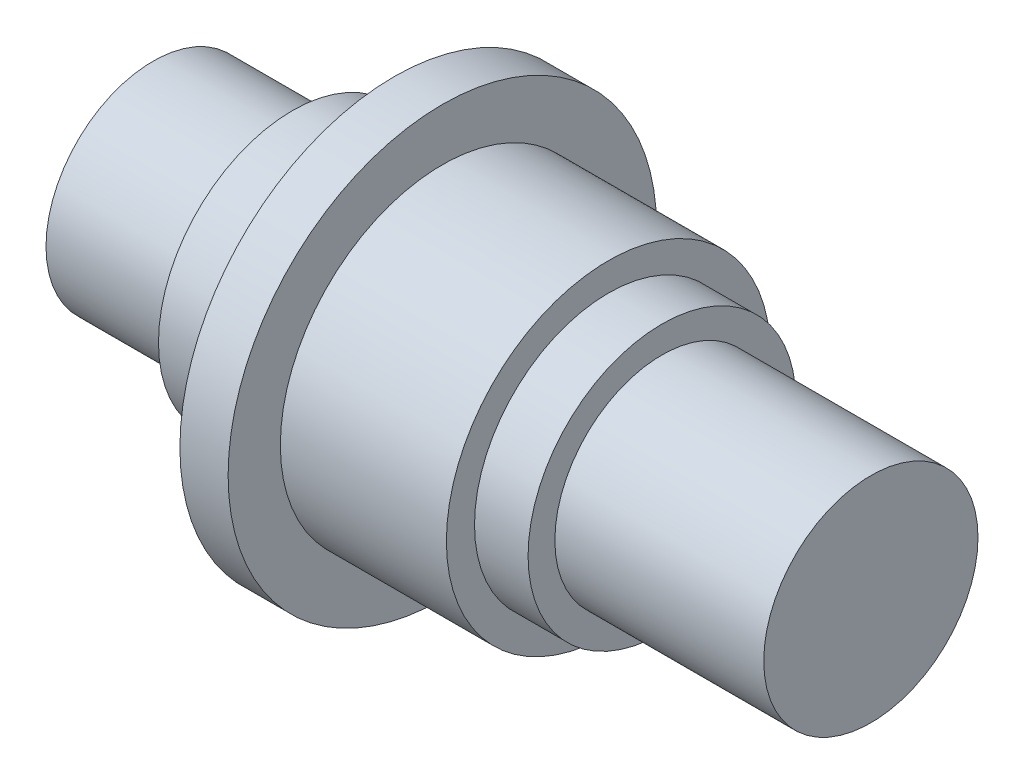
ISO-10303-21;
HEADER;
FILE_DESCRIPTION(('STEP AP214'),'2;1');
FILE_NAME('part.step','',(''),(''),'','','');
FILE_SCHEMA(('AUTOMOTIVE_DESIGN { 1 0 10303 214 1 1 1 1 }'));
ENDSEC;
DATA;
#1=APPLICATION_CONTEXT('core data for automotive mechanical design processes');
#2=APPLICATION_PROTOCOL_DEFINITION('international standard','automotive_design',2000,#1);
#3=PRODUCT_CONTEXT('',#1,'mechanical');
#4=PRODUCT('Part','Part','',(#3));
#5=PRODUCT_RELATED_PRODUCT_CATEGORY('part','',(#4));
#6=PRODUCT_DEFINITION_FORMATION('','',#4);
#7=PRODUCT_DEFINITION_CONTEXT('part definition',#1,'design');
#8=PRODUCT_DEFINITION('design','',#6,#7);
#9=PRODUCT_DEFINITION_SHAPE('','',#8);
#10=(LENGTH_UNIT() NAMED_UNIT(*) SI_UNIT(.MILLI.,.METRE.));
#11=(NAMED_UNIT(*) PLANE_ANGLE_UNIT() SI_UNIT($,.RADIAN.));
#12=(NAMED_UNIT(*) SI_UNIT($,.STERADIAN.) SOLID_ANGLE_UNIT());
#13=UNCERTAINTY_MEASURE_WITH_UNIT(LENGTH_MEASURE(1.E-05),#10,'distance_accuracy_value','');
#14=(GEOMETRIC_REPRESENTATION_CONTEXT(3) GLOBAL_UNCERTAINTY_ASSIGNED_CONTEXT((#13)) GLOBAL_UNIT_ASSIGNED_CONTEXT((#10,
#11,#12)) REPRESENTATION_CONTEXT('',''));
#15=CARTESIAN_POINT('',(0.,0.,0.));
#16=DIRECTION('',(0.,0.,1.));
#17=DIRECTION('',(1.,0.,0.));
#18=AXIS2_PLACEMENT_3D('',#15,#16,#17);
#19=CARTESIAN_POINT('',(2.45,0.,0.));
#20=DIRECTION('',(-1.,0.,0.));
#21=DIRECTION('',(0.,0.,1.));
#22=AXIS2_PLACEMENT_3D('',#19,#20,#21);
#23=CYLINDRICAL_SURFACE('',#22,3.025);
#24=CARTESIAN_POINT('',(2.45,0.,0.));
#25=DIRECTION('',(1.,0.,0.));
#26=DIRECTION('',(0.,0.,-1.));
#27=AXIS2_PLACEMENT_3D('',#24,#25,#26);
#28=CIRCLE('',#27,3.025);
#29=CARTESIAN_POINT('',(2.45,0.,-3.025));
#30=VERTEX_POINT('',#29);
#31=EDGE_CURVE('E55',#30,#30,#28,.T.);
#32=ORIENTED_EDGE('',*,*,#31,.F.);
#33=EDGE_LOOP('',(#32));
#34=FACE_BOUND('',#33,.T.);
#35=CARTESIAN_POINT('',(-0.65,0.,0.));
#36=DIRECTION('',(-1.,0.,0.));
#37=DIRECTION('',(0.,0.,1.));
#38=AXIS2_PLACEMENT_3D('',#35,#36,#37);
#39=CIRCLE('',#38,3.025);
#40=CARTESIAN_POINT('',(-0.65,0.,3.025));
#41=VERTEX_POINT('',#40);
#42=EDGE_CURVE('E10',#41,#41,#39,.T.);
#43=ORIENTED_EDGE('',*,*,#42,.F.);
#44=EDGE_LOOP('',(#43));
#45=FACE_BOUND('',#44,.T.);
#46=ADVANCED_FACE('F33',(#34,#45),#23,.T.);
#47=CARTESIAN_POINT('',(-6.05,0.,0.));
#48=DIRECTION('',(1.,0.,0.));
#49=DIRECTION('',(0.,0.,-1.));
#50=AXIS2_PLACEMENT_3D('',#47,#48,#49);
#51=CYLINDRICAL_SURFACE('',#50,2.);
#52=CARTESIAN_POINT('',(7.35,0.,0.));
#53=DIRECTION('',(1.,0.,0.));
#54=DIRECTION('',(0.,0.,-1.));
#55=AXIS2_PLACEMENT_3D('',#52,#53,#54);
#56=CIRCLE('',#55,2.);
#57=CARTESIAN_POINT('',(7.35,0.,-2.));
#58=VERTEX_POINT('',#57);
#59=EDGE_CURVE('E49',#58,#58,#56,.T.);
#60=ORIENTED_EDGE('',*,*,#59,.F.);
#61=EDGE_LOOP('',(#60));
#62=FACE_BOUND('',#61,.T.);
#63=CARTESIAN_POINT('',(3.45,0.,0.));
#64=DIRECTION('',(-1.,0.,0.));
#65=DIRECTION('',(0.,0.,1.));
#66=AXIS2_PLACEMENT_3D('',#63,#64,#65);
#67=CIRCLE('',#66,2.);
#68=CARTESIAN_POINT('',(3.45,0.,2.));
#69=VERTEX_POINT('',#68);
#70=EDGE_CURVE('E53',#69,#69,#67,.F.);
#71=ORIENTED_EDGE('',*,*,#70,.T.);
#72=EDGE_LOOP('',(#71));
#73=FACE_BOUND('',#72,.T.);
#74=ADVANCED_FACE('F35',(#62,#73),#51,.T.);
#75=CARTESIAN_POINT('',(7.35,0.,0.));
#76=DIRECTION('',(1.,0.,0.));
#77=DIRECTION('',(0.,0.,-1.));
#78=AXIS2_PLACEMENT_3D('',#75,#76,#77);
#79=PLANE('',#78);
#80=ORIENTED_EDGE('',*,*,#59,.T.);
#81=EDGE_LOOP('',(#80));
#82=FACE_BOUND('',#81,.T.);
#83=ADVANCED_FACE('F82',(#82),#79,.T.);
#84=CARTESIAN_POINT('',(-3.45,0.,0.));
#85=DIRECTION('',(1.,0.,0.));
#86=DIRECTION('',(0.,0.,-1.));
#87=AXIS2_PLACEMENT_3D('',#84,#85,#86);
#88=CYLINDRICAL_SURFACE('',#87,2.5);
#89=CARTESIAN_POINT('',(2.45,0.,0.));
#90=DIRECTION('',(1.,0.,0.));
#91=DIRECTION('',(0.,0.,-1.));
#92=AXIS2_PLACEMENT_3D('',#89,#90,#91);
#93=CIRCLE('',#92,2.5);
#94=CARTESIAN_POINT('',(2.45,0.,-2.5));
#95=VERTEX_POINT('',#94);
#96=EDGE_CURVE('E56',#95,#95,#93,.F.);
#97=CARTESIAN_POINT('',(3.45,0.,0.));
#98=DIRECTION('',(-1.,0.,0.));
#99=DIRECTION('',(0.,0.,1.));
#100=AXIS2_PLACEMENT_3D('',#97,#98,#99);
#101=CIRCLE('',#100,2.5);
#102=CARTESIAN_POINT('',(3.45,0.,-2.5));
#103=VERTEX_POINT('',#102);
#104=EDGE_CURVE('E59',#103,#103,#101,.T.);
#105=CARTESIAN_POINT('',(2.45,0.,-2.5));
#106=CARTESIAN_POINT('',(2.46041666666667,0.,-2.5));
#107=CARTESIAN_POINT('',(2.47083333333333,0.,-2.5));
#108=CARTESIAN_POINT('',(2.49166666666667,0.,-2.5));
#109=CARTESIAN_POINT('',(2.50208333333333,0.,-2.5));
#110=CARTESIAN_POINT('',(2.52291666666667,0.,-2.5));
#111=CARTESIAN_POINT('',(2.53333333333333,0.,-2.5));
#112=CARTESIAN_POINT('',(2.55416666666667,0.,-2.5));
#113=CARTESIAN_POINT('',(2.56458333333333,0.,-2.5));
#114=CARTESIAN_POINT('',(2.58541666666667,0.,-2.5));
#115=CARTESIAN_POINT('',(2.59583333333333,0.,-2.5));
#116=CARTESIAN_POINT('',(2.61666666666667,0.,-2.5));
#117=CARTESIAN_POINT('',(2.62708333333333,0.,-2.5));
#118=CARTESIAN_POINT('',(2.64791666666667,0.,-2.5));
#119=CARTESIAN_POINT('',(2.65833333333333,0.,-2.5));
#120=CARTESIAN_POINT('',(2.67916666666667,0.,-2.5));
#121=CARTESIAN_POINT('',(2.68958333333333,0.,-2.5));
#122=CARTESIAN_POINT('',(2.71041666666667,0.,-2.5));
#123=CARTESIAN_POINT('',(2.72083333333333,0.,-2.5));
#124=CARTESIAN_POINT('',(2.74166666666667,0.,-2.5));
#125=CARTESIAN_POINT('',(2.75208333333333,0.,-2.5));
#126=CARTESIAN_POINT('',(2.77291666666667,0.,-2.5));
#127=CARTESIAN_POINT('',(2.78333333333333,0.,-2.5));
#128=CARTESIAN_POINT('',(2.80416666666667,0.,-2.5));
#129=CARTESIAN_POINT('',(2.81458333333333,0.,-2.5));
#130=CARTESIAN_POINT('',(2.83541666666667,0.,-2.5));
#131=CARTESIAN_POINT('',(2.84583333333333,0.,-2.5));
#132=CARTESIAN_POINT('',(2.86666666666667,0.,-2.5));
#133=CARTESIAN_POINT('',(2.87708333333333,0.,-2.5));
#134=CARTESIAN_POINT('',(2.89791666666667,0.,-2.5));
#135=CARTESIAN_POINT('',(2.90833333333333,0.,-2.5));
#136=CARTESIAN_POINT('',(2.92916666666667,0.,-2.5));
#137=CARTESIAN_POINT('',(2.93958333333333,0.,-2.5));
#138=CARTESIAN_POINT('',(2.96041666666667,0.,-2.5));
#139=CARTESIAN_POINT('',(2.97083333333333,0.,-2.5));
#140=CARTESIAN_POINT('',(2.99166666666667,0.,-2.5));
#141=CARTESIAN_POINT('',(3.00208333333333,0.,-2.5));
#142=CARTESIAN_POINT('',(3.02291666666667,0.,-2.5));
#143=CARTESIAN_POINT('',(3.03333333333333,0.,-2.5));
#144=CARTESIAN_POINT('',(3.05416666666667,0.,-2.5));
#145=CARTESIAN_POINT('',(3.06458333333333,0.,-2.5));
#146=CARTESIAN_POINT('',(3.08541666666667,0.,-2.5));
#147=CARTESIAN_POINT('',(3.09583333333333,0.,-2.5));
#148=CARTESIAN_POINT('',(3.11666666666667,0.,-2.5));
#149=CARTESIAN_POINT('',(3.12708333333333,0.,-2.5));
#150=CARTESIAN_POINT('',(3.14791666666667,0.,-2.5));
#151=CARTESIAN_POINT('',(3.15833333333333,0.,-2.5));
#152=CARTESIAN_POINT('',(3.17916666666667,0.,-2.5));
#153=CARTESIAN_POINT('',(3.18958333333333,0.,-2.5));
#154=CARTESIAN_POINT('',(3.21041666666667,0.,-2.5));
#155=CARTESIAN_POINT('',(3.22083333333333,0.,-2.5));
#156=CARTESIAN_POINT('',(3.24166666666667,0.,-2.5));
#157=CARTESIAN_POINT('',(3.25208333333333,0.,-2.5));
#158=CARTESIAN_POINT('',(3.27291666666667,0.,-2.5));
#159=CARTESIAN_POINT('',(3.28333333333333,0.,-2.5));
#160=CARTESIAN_POINT('',(3.30416666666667,0.,-2.5));
#161=CARTESIAN_POINT('',(3.31458333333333,0.,-2.5));
#162=CARTESIAN_POINT('',(3.33541666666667,0.,-2.5));
#163=CARTESIAN_POINT('',(3.34583333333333,0.,-2.5));
#164=CARTESIAN_POINT('',(3.36666666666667,0.,-2.5));
#165=CARTESIAN_POINT('',(3.37708333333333,0.,-2.5));
#166=CARTESIAN_POINT('',(3.39791666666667,0.,-2.5));
#167=CARTESIAN_POINT('',(3.40833333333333,0.,-2.5));
#168=CARTESIAN_POINT('',(3.42916666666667,0.,-2.5));
#169=CARTESIAN_POINT('',(3.43958333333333,0.,-2.5));
#170=CARTESIAN_POINT('',(3.45,0.,-2.5));
#171=B_SPLINE_CURVE_WITH_KNOTS('',3,(#105,#106,#107,#108,#109,#110,#111,#112,#113,#114,#115,
#116,#117,#118,#119,#120,#121,#122,#123,#124,#125,#126,#127,#128,#129,#130,#131,#132,#133,#134,
#135,#136,#137,#138,#139,#140,#141,#142,#143,#144,#145,#146,#147,#148,#149,#150,#151,#152,#153,
#154,#155,#156,#157,#158,#159,#160,#161,#162,#163,#164,#165,#166,#167,#168,#169,#170),
.UNSPECIFIED.,.F.,.F.,(4,2,2,2,2,2,2,2,2,2,2,2,2,2,2,2,2,2,2,2,2,2,2,2,2,2,2,2,2,2,2,2,4),(0.,
0.03125,0.0625000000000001,0.0937500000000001,0.125,0.15625,0.1875,0.21875,0.25,0.28125,0.3125,
0.34375,0.375,0.40625,0.4375,0.46875,0.5,0.53125,0.5625,0.593750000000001,0.625000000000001,
0.656250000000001,0.687500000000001,0.718750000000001,0.750000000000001,0.781250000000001,
0.812500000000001,0.843750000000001,0.875000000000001,0.906250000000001,0.937500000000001,
0.968750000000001,1.),.UNSPECIFIED.);
#172=EDGE_CURVE('BSEAM93',#95,#103,#171,.T.);
#173=ORIENTED_EDGE('',*,*,#96,.F.);
#174=ORIENTED_EDGE('',*,*,#104,.T.);
#175=ORIENTED_EDGE('',*,*,#172,.T.);
#176=ORIENTED_EDGE('',*,*,#172,.F.);
#177=EDGE_LOOP('',(#173,#175,#174,#176));
#178=FACE_BOUND('',#177,.T.);
#179=ADVANCED_FACE('F93',(#178),#88,.T.);
#180=CARTESIAN_POINT('',(3.45,0.,0.));
#181=DIRECTION('',(-1.,0.,0.));
#182=DIRECTION('',(0.,0.,1.));
#183=AXIS2_PLACEMENT_3D('',#180,#181,#182);
#184=PLANE('',#183);
#185=ORIENTED_EDGE('',*,*,#70,.F.);
#186=EDGE_LOOP('',(#185));
#187=FACE_BOUND('',#186,.T.);
#188=ORIENTED_EDGE('',*,*,#104,.F.);
#189=EDGE_LOOP('',(#188));
#190=FACE_BOUND('',#189,.T.);
#191=ADVANCED_FACE('F89',(#187,#190),#184,.F.);
#192=CARTESIAN_POINT('',(2.45,0.,0.));
#193=DIRECTION('',(1.,0.,0.));
#194=DIRECTION('',(0.,0.,-1.));
#195=AXIS2_PLACEMENT_3D('',#192,#193,#194);
#196=PLANE('',#195);
#197=ORIENTED_EDGE('',*,*,#96,.T.);
#198=EDGE_LOOP('',(#197));
#199=FACE_BOUND('',#198,.T.);
#200=ORIENTED_EDGE('',*,*,#31,.T.);
#201=EDGE_LOOP('',(#200));
#202=FACE_BOUND('',#201,.T.);
#203=ADVANCED_FACE('F92',(#199,#202),#196,.T.);
#204=CARTESIAN_POINT('',(-0.65,0.,0.));
#205=DIRECTION('',(-1.,0.,0.));
#206=DIRECTION('',(0.,0.,1.));
#207=AXIS2_PLACEMENT_3D('',#204,#205,#206);
#208=CYLINDRICAL_SURFACE('',#207,4.);
#209=CARTESIAN_POINT('',(-0.65,0.,0.));
#210=DIRECTION('',(-1.,0.,0.));
#211=DIRECTION('',(0.,0.,1.));
#212=AXIS2_PLACEMENT_3D('',#209,#210,#211);
#213=CIRCLE('',#212,4.);
#214=CARTESIAN_POINT('',(-0.65,0.,4.));
#215=VERTEX_POINT('',#214);
#216=EDGE_CURVE('E60',#215,#215,#213,.T.);
#217=ORIENTED_EDGE('',*,*,#216,.T.);
#218=EDGE_LOOP('',(#217));
#219=FACE_BOUND('',#218,.T.);
#220=CARTESIAN_POINT('',(-1.55,0.,0.));
#221=DIRECTION('',(-1.,0.,0.));
#222=DIRECTION('',(0.,0.,1.));
#223=AXIS2_PLACEMENT_3D('',#220,#221,#222);
#224=CIRCLE('',#223,4.);
#225=CARTESIAN_POINT('',(-1.55,0.,4.));
#226=VERTEX_POINT('',#225);
#227=EDGE_CURVE('E67',#226,#226,#224,.T.);
#228=ORIENTED_EDGE('',*,*,#227,.F.);
#229=EDGE_LOOP('',(#228));
#230=FACE_BOUND('',#229,.T.);
#231=ADVANCED_FACE('F133',(#219,#230),#208,.T.);
#232=CARTESIAN_POINT('',(-0.65,0.,0.));
#233=DIRECTION('',(-1.,0.,0.));
#234=DIRECTION('',(0.,0.,1.));
#235=AXIS2_PLACEMENT_3D('',#232,#233,#234);
#236=PLANE('',#235);
#237=ORIENTED_EDGE('',*,*,#42,.T.);
#238=EDGE_LOOP('',(#237));
#239=FACE_BOUND('',#238,.T.);
#240=ORIENTED_EDGE('',*,*,#216,.F.);
#241=EDGE_LOOP('',(#240));
#242=FACE_BOUND('',#241,.T.);
#243=ADVANCED_FACE('F125',(#239,#242),#236,.F.);
#244=CARTESIAN_POINT('',(-1.55,0.,0.));
#245=DIRECTION('',(-1.,0.,0.));
#246=DIRECTION('',(0.,0.,1.));
#247=AXIS2_PLACEMENT_3D('',#244,#245,#246);
#248=PLANE('',#247);
#249=CARTESIAN_POINT('',(-1.55,0.,0.));
#250=DIRECTION('',(-1.,0.,0.));
#251=DIRECTION('',(0.,0.,1.));
#252=AXIS2_PLACEMENT_3D('',#249,#250,#251);
#253=CIRCLE('',#252,2.5);
#254=CARTESIAN_POINT('',(-1.55,0.,-2.5));
#255=VERTEX_POINT('',#254);
#256=EDGE_CURVE('E57',#255,#255,#253,.T.);
#257=ORIENTED_EDGE('',*,*,#256,.F.);
#258=EDGE_LOOP('',(#257));
#259=FACE_BOUND('',#258,.T.);
#260=ORIENTED_EDGE('',*,*,#227,.T.);
#261=EDGE_LOOP('',(#260));
#262=FACE_BOUND('',#261,.T.);
#263=ADVANCED_FACE('F118',(#259,#262),#248,.T.);
#264=CARTESIAN_POINT('',(-6.05,0.,0.));
#265=DIRECTION('',(1.,0.,0.));
#266=DIRECTION('',(0.,0.,-1.));
#267=AXIS2_PLACEMENT_3D('',#264,#265,#266);
#268=PLANE('',#267);
#269=CARTESIAN_POINT('',(-6.05,0.,0.));
#270=DIRECTION('',(1.,0.,0.));
#271=DIRECTION('',(0.,0.,-1.));
#272=AXIS2_PLACEMENT_3D('',#269,#270,#271);
#273=CIRCLE('',#272,2.);
#274=CARTESIAN_POINT('',(-6.05,0.,-2.));
#275=VERTEX_POINT('',#274);
#276=EDGE_CURVE('E44',#275,#275,#273,.T.);
#277=ORIENTED_EDGE('',*,*,#276,.F.);
#278=EDGE_LOOP('',(#277));
#279=FACE_BOUND('',#278,.T.);
#280=ADVANCED_FACE('F116',(#279),#268,.F.);
#281=CARTESIAN_POINT('',(-3.45,0.,0.));
#282=DIRECTION('',(-1.,0.,0.));
#283=DIRECTION('',(0.,0.,1.));
#284=AXIS2_PLACEMENT_3D('',#281,#282,#283);
#285=CIRCLE('',#284,2.);
#286=CARTESIAN_POINT('',(-3.45,0.,2.));
#287=VERTEX_POINT('',#286);
#288=EDGE_CURVE('E40',#287,#287,#285,.F.);
#289=ORIENTED_EDGE('',*,*,#288,.F.);
#290=EDGE_LOOP('',(#289));
#291=FACE_BOUND('',#290,.T.);
#292=ORIENTED_EDGE('',*,*,#276,.T.);
#293=EDGE_LOOP('',(#292));
#294=FACE_BOUND('',#293,.T.);
#295=ADVANCED_FACE('F86',(#291,#294),#51,.T.);
#296=CARTESIAN_POINT('',(-3.45,0.,0.));
#297=DIRECTION('',(-1.,0.,0.));
#298=DIRECTION('',(0.,0.,1.));
#299=AXIS2_PLACEMENT_3D('',#296,#297,#298);
#300=PLANE('',#299);
#301=ORIENTED_EDGE('',*,*,#288,.T.);
#302=EDGE_LOOP('',(#301));
#303=FACE_BOUND('',#302,.T.);
#304=CARTESIAN_POINT('',(-3.45,0.,0.));
#305=DIRECTION('',(-1.,0.,0.));
#306=DIRECTION('',(0.,0.,1.));
#307=AXIS2_PLACEMENT_3D('',#304,#305,#306);
#308=CIRCLE('',#307,2.5);
#309=CARTESIAN_POINT('',(-3.45,0.,-2.5));
#310=VERTEX_POINT('',#309);
#311=EDGE_CURVE('E64',#310,#310,#308,.T.);
#312=ORIENTED_EDGE('',*,*,#311,.T.);
#313=EDGE_LOOP('',(#312));
#314=FACE_BOUND('',#313,.T.);
#315=ADVANCED_FACE('F108',(#303,#314),#300,.T.);
#316=CARTESIAN_POINT('',(-1.55,0.,-2.5));
#317=CARTESIAN_POINT('',(-1.56979166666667,0.,-2.5));
#318=CARTESIAN_POINT('',(-1.58958333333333,0.,-2.5));
#319=CARTESIAN_POINT('',(-1.62916666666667,0.,-2.5));
#320=CARTESIAN_POINT('',(-1.64895833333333,0.,-2.5));
#321=CARTESIAN_POINT('',(-1.68854166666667,0.,-2.5));
#322=CARTESIAN_POINT('',(-1.70833333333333,0.,-2.5));
#323=CARTESIAN_POINT('',(-1.74791666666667,0.,-2.5));
#324=CARTESIAN_POINT('',(-1.76770833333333,0.,-2.5));
#325=CARTESIAN_POINT('',(-1.80729166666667,0.,-2.5));
#326=CARTESIAN_POINT('',(-1.82708333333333,0.,-2.5));
#327=CARTESIAN_POINT('',(-1.86666666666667,0.,-2.5));
#328=CARTESIAN_POINT('',(-1.88645833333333,0.,-2.5));
#329=CARTESIAN_POINT('',(-1.92604166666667,0.,-2.5));
#330=CARTESIAN_POINT('',(-1.94583333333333,0.,-2.5));
#331=CARTESIAN_POINT('',(-1.98541666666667,0.,-2.5));
#332=CARTESIAN_POINT('',(-2.00520833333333,0.,-2.5));
#333=CARTESIAN_POINT('',(-2.04479166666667,0.,-2.5));
#334=CARTESIAN_POINT('',(-2.06458333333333,0.,-2.5));
#335=CARTESIAN_POINT('',(-2.10416666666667,0.,-2.5));
#336=CARTESIAN_POINT('',(-2.12395833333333,0.,-2.5));
#337=CARTESIAN_POINT('',(-2.16354166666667,0.,-2.5));
#338=CARTESIAN_POINT('',(-2.18333333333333,0.,-2.5));
#339=CARTESIAN_POINT('',(-2.22291666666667,0.,-2.5));
#340=CARTESIAN_POINT('',(-2.24270833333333,0.,-2.5));
#341=CARTESIAN_POINT('',(-2.28229166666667,0.,-2.5));
#342=CARTESIAN_POINT('',(-2.30208333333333,0.,-2.5));
#343=CARTESIAN_POINT('',(-2.34166666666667,0.,-2.5));
#344=CARTESIAN_POINT('',(-2.36145833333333,0.,-2.5));
#345=CARTESIAN_POINT('',(-2.40104166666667,0.,-2.5));
#346=CARTESIAN_POINT('',(-2.42083333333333,0.,-2.5));
#347=CARTESIAN_POINT('',(-2.46041666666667,0.,-2.5));
#348=CARTESIAN_POINT('',(-2.48020833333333,0.,-2.5));
#349=CARTESIAN_POINT('',(-2.51979166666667,0.,-2.5));
#350=CARTESIAN_POINT('',(-2.53958333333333,0.,-2.5));
#351=CARTESIAN_POINT('',(-2.57916666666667,0.,-2.5));
#352=CARTESIAN_POINT('',(-2.59895833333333,0.,-2.5));
#353=CARTESIAN_POINT('',(-2.63854166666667,0.,-2.5));
#354=CARTESIAN_POINT('',(-2.65833333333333,0.,-2.5));
#355=CARTESIAN_POINT('',(-2.69791666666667,0.,-2.5));
#356=CARTESIAN_POINT('',(-2.71770833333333,0.,-2.5));
#357=CARTESIAN_POINT('',(-2.75729166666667,0.,-2.5));
#358=CARTESIAN_POINT('',(-2.77708333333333,0.,-2.5));
#359=CARTESIAN_POINT('',(-2.81666666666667,0.,-2.5));
#360=CARTESIAN_POINT('',(-2.83645833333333,0.,-2.5));
#361=CARTESIAN_POINT('',(-2.87604166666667,0.,-2.5));
#362=CARTESIAN_POINT('',(-2.89583333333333,0.,-2.5));
#363=CARTESIAN_POINT('',(-2.93541666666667,0.,-2.5));
#364=CARTESIAN_POINT('',(-2.95520833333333,0.,-2.5));
#365=CARTESIAN_POINT('',(-2.99479166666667,0.,-2.5));
#366=CARTESIAN_POINT('',(-3.01458333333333,0.,-2.5));
#367=CARTESIAN_POINT('',(-3.05416666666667,0.,-2.5));
#368=CARTESIAN_POINT('',(-3.07395833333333,0.,-2.5));
#369=CARTESIAN_POINT('',(-3.11354166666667,0.,-2.5));
#370=CARTESIAN_POINT('',(-3.13333333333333,0.,-2.5));
#371=CARTESIAN_POINT('',(-3.17291666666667,0.,-2.5));
#372=CARTESIAN_POINT('',(-3.19270833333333,0.,-2.5));
#373=CARTESIAN_POINT('',(-3.23229166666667,0.,-2.5));
#374=CARTESIAN_POINT('',(-3.25208333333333,0.,-2.5));
#375=CARTESIAN_POINT('',(-3.29166666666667,0.,-2.5));
#376=CARTESIAN_POINT('',(-3.31145833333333,0.,-2.5));
#377=CARTESIAN_POINT('',(-3.35104166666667,0.,-2.5));
#378=CARTESIAN_POINT('',(-3.37083333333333,0.,-2.5));
#379=CARTESIAN_POINT('',(-3.41041666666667,0.,-2.5));
#380=CARTESIAN_POINT('',(-3.43020833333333,0.,-2.5));
#381=CARTESIAN_POINT('',(-3.45,0.,-2.5));
#382=B_SPLINE_CURVE_WITH_KNOTS('',3,(#316,#317,#318,#319,#320,#321,#322,#323,#324,#325,#326,
#327,#328,#329,#330,#331,#332,#333,#334,#335,#336,#337,#338,#339,#340,#341,#342,#343,#344,#345,
#346,#347,#348,#349,#350,#351,#352,#353,#354,#355,#356,#357,#358,#359,#360,#361,#362,#363,#364,
#365,#366,#367,#368,#369,#370,#371,#372,#373,#374,#375,#376,#377,#378,#379,#380,#381),
.UNSPECIFIED.,.F.,.F.,(4,2,2,2,2,2,2,2,2,2,2,2,2,2,2,2,2,2,2,2,2,2,2,2,2,2,2,2,2,2,2,2,4),(0.,
0.059375,0.11875,0.178125,0.2375,0.296875,0.35625,0.415625,0.475,0.534375,0.59375,0.653125,
0.7125,0.771875,0.83125,0.890625,0.95,1.009375,1.06875,1.128125,1.1875,1.246875,1.30625,
1.365625,1.425,1.484375,1.54375,1.603125,1.6625,1.721875,1.78125,1.840625,1.9),.UNSPECIFIED.);
#383=EDGE_CURVE('BSEAM100',#255,#310,#382,.T.);
#384=ORIENTED_EDGE('',*,*,#256,.T.);
#385=ORIENTED_EDGE('',*,*,#311,.F.);
#386=ORIENTED_EDGE('',*,*,#383,.T.);
#387=ORIENTED_EDGE('',*,*,#383,.F.);
#388=EDGE_LOOP('',(#384,#386,#385,#387));
#389=FACE_BOUND('',#388,.T.);
#390=ADVANCED_FACE('F100',(#389),#88,.T.);
#391=CLOSED_SHELL('',(#46,#74,#83,#179,#191,#203,#231,#243,#263,#280,#295,#315,#390));
#392=MANIFOLD_SOLID_BREP('B2',#391);
#393=ADVANCED_BREP_SHAPE_REPRESENTATION('',(#18,#392),#14);
#394=SHAPE_DEFINITION_REPRESENTATION(#9,#393);
ENDSEC;
END-ISO-10303-21;
